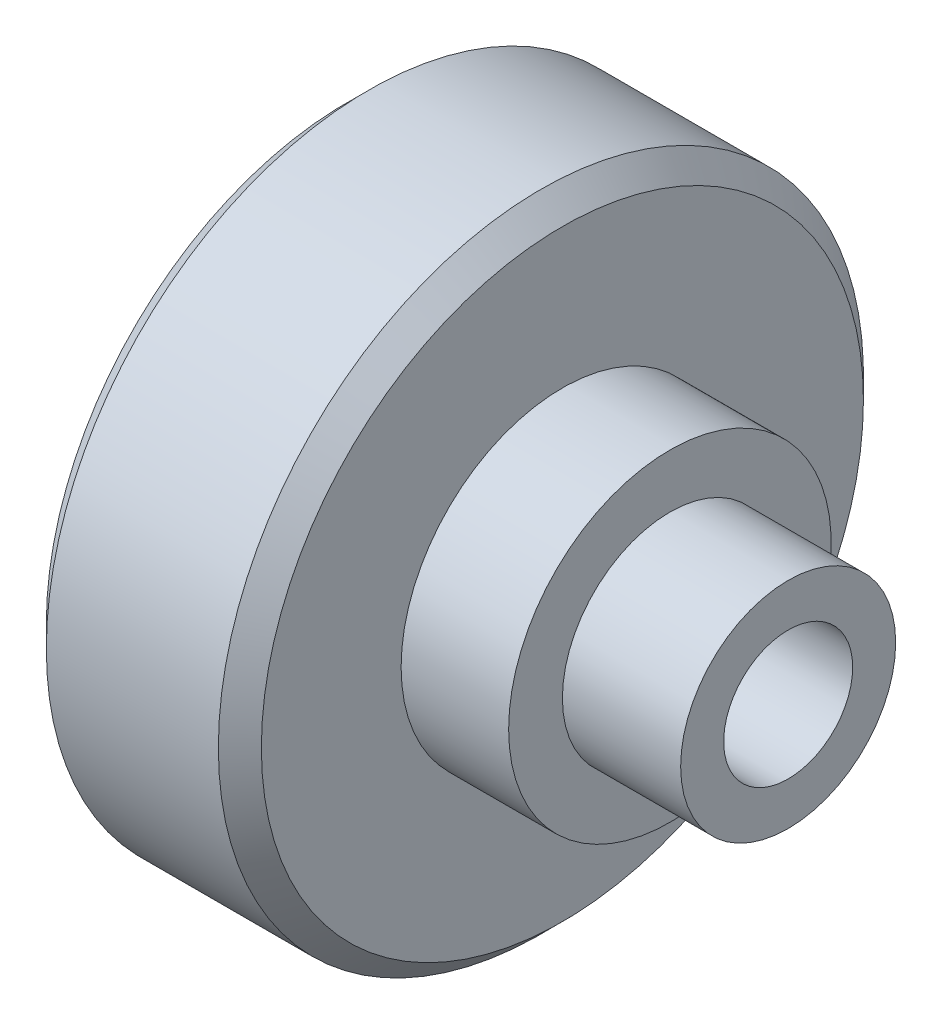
ISO-10303-21;
HEADER;
FILE_DESCRIPTION(('STEP AP214'),'2;1');
FILE_NAME('part.step','',(''),(''),'','','');
FILE_SCHEMA(('AUTOMOTIVE_DESIGN { 1 0 10303 214 1 1 1 1 }'));
ENDSEC;
DATA;
#1=APPLICATION_CONTEXT('core data for automotive mechanical design processes');
#2=APPLICATION_PROTOCOL_DEFINITION('international standard','automotive_design',2000,#1);
#3=PRODUCT_CONTEXT('',#1,'mechanical');
#4=PRODUCT('Part','Part','',(#3));
#5=PRODUCT_RELATED_PRODUCT_CATEGORY('part','',(#4));
#6=PRODUCT_DEFINITION_FORMATION('','',#4);
#7=PRODUCT_DEFINITION_CONTEXT('part definition',#1,'design');
#8=PRODUCT_DEFINITION('design','',#6,#7);
#9=PRODUCT_DEFINITION_SHAPE('','',#8);
#10=(LENGTH_UNIT() NAMED_UNIT(*) SI_UNIT(.MILLI.,.METRE.));
#11=(NAMED_UNIT(*) PLANE_ANGLE_UNIT() SI_UNIT($,.RADIAN.));
#12=(NAMED_UNIT(*) SI_UNIT($,.STERADIAN.) SOLID_ANGLE_UNIT());
#13=UNCERTAINTY_MEASURE_WITH_UNIT(LENGTH_MEASURE(1.E-05),#10,'distance_accuracy_value','');
#14=(GEOMETRIC_REPRESENTATION_CONTEXT(3) GLOBAL_UNCERTAINTY_ASSIGNED_CONTEXT((#13)) GLOBAL_UNIT_ASSIGNED_CONTEXT((#10,
#11,#12)) REPRESENTATION_CONTEXT('',''));
#15=CARTESIAN_POINT('',(0.,0.,0.));
#16=DIRECTION('',(0.,0.,1.));
#17=DIRECTION('',(1.,0.,0.));
#18=AXIS2_PLACEMENT_3D('',#15,#16,#17);
#19=CARTESIAN_POINT('',(0.,0.,-15.));
#20=DIRECTION('',(1.,0.,0.));
#21=DIRECTION('',(0.,0.,-1.));
#22=AXIS2_PLACEMENT_3D('',#19,#20,#21);
#23=PLANE('',#22);
#24=CARTESIAN_POINT('',(0.,0.,0.));
#25=DIRECTION('',(1.,0.,0.));
#26=DIRECTION('',(0.,0.,-1.));
#27=AXIS2_PLACEMENT_3D('',#24,#25,#26);
#28=CIRCLE('',#27,14.);
#29=CARTESIAN_POINT('',(0.,0.,-14.));
#30=VERTEX_POINT('',#29);
#31=EDGE_CURVE('E44',#30,#30,#28,.F.);
#32=ORIENTED_EDGE('',*,*,#31,.T.);
#33=EDGE_LOOP('',(#32));
#34=FACE_BOUND('',#33,.T.);
#35=CARTESIAN_POINT('',(0.,0.,0.));
#36=DIRECTION('',(1.,0.,0.));
#37=DIRECTION('',(0.,0.,-1.));
#38=AXIS2_PLACEMENT_3D('',#35,#36,#37);
#39=CIRCLE('',#38,3.);
#40=CARTESIAN_POINT('',(0.,0.,-3.));
#41=VERTEX_POINT('',#40);
#42=EDGE_CURVE('E61',#41,#41,#39,.T.);
#43=ORIENTED_EDGE('',*,*,#42,.T.);
#44=EDGE_LOOP('',(#43));
#45=FACE_BOUND('',#44,.T.);
#46=ADVANCED_FACE('F30',(#34,#45),#23,.F.);
#47=CARTESIAN_POINT('',(20.5,0.,0.));
#48=DIRECTION('',(-1.,0.,0.));
#49=DIRECTION('',(0.,0.,1.));
#50=AXIS2_PLACEMENT_3D('',#47,#48,#49);
#51=PLANE('',#50);
#52=CARTESIAN_POINT('',(20.5,0.,0.));
#53=DIRECTION('',(1.,0.,0.));
#54=DIRECTION('',(0.,0.,-1.));
#55=AXIS2_PLACEMENT_3D('',#52,#53,#54);
#56=CIRCLE('',#55,3.);
#57=CARTESIAN_POINT('',(20.5,0.,-3.));
#58=VERTEX_POINT('',#57);
#59=EDGE_CURVE('E64',#58,#58,#56,.T.);
#60=ORIENTED_EDGE('',*,*,#59,.F.);
#61=EDGE_LOOP('',(#60));
#62=FACE_BOUND('',#61,.T.);
#63=CARTESIAN_POINT('',(20.5,0.,0.));
#64=DIRECTION('',(-1.,0.,0.));
#65=DIRECTION('',(0.,0.,1.));
#66=AXIS2_PLACEMENT_3D('',#63,#64,#65);
#67=CIRCLE('',#66,4.99999999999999);
#68=CARTESIAN_POINT('',(20.5,0.,4.99999999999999));
#69=VERTEX_POINT('',#68);
#70=EDGE_CURVE('E49',#69,#69,#67,.T.);
#71=ORIENTED_EDGE('',*,*,#70,.F.);
#72=EDGE_LOOP('',(#71));
#73=FACE_BOUND('',#72,.T.);
#74=ADVANCED_FACE('F70',(#62,#73),#51,.F.);
#75=CARTESIAN_POINT('',(0.,0.,0.));
#76=DIRECTION('',(-1.,0.,0.));
#77=DIRECTION('',(0.,0.,1.));
#78=AXIS2_PLACEMENT_3D('',#75,#76,#77);
#79=CYLINDRICAL_SURFACE('',#78,4.99999999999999);
#80=CARTESIAN_POINT('',(15.,0.,0.));
#81=DIRECTION('',(-1.,0.,0.));
#82=DIRECTION('',(0.,0.,1.));
#83=AXIS2_PLACEMENT_3D('',#80,#81,#82);
#84=CIRCLE('',#83,4.99999999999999);
#85=CARTESIAN_POINT('',(15.,0.,4.99999999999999));
#86=VERTEX_POINT('',#85);
#87=EDGE_CURVE('E52',#86,#86,#84,.T.);
#88=ORIENTED_EDGE('',*,*,#87,.F.);
#89=EDGE_LOOP('',(#88));
#90=FACE_BOUND('',#89,.T.);
#91=ORIENTED_EDGE('',*,*,#70,.T.);
#92=EDGE_LOOP('',(#91));
#93=FACE_BOUND('',#92,.T.);
#94=ADVANCED_FACE('F73',(#90,#93),#79,.T.);
#95=CARTESIAN_POINT('',(15.,0.,-4.99999999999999));
#96=DIRECTION('',(-1.,0.,0.));
#97=DIRECTION('',(0.,0.,1.));
#98=AXIS2_PLACEMENT_3D('',#95,#96,#97);
#99=PLANE('',#98);
#100=CARTESIAN_POINT('',(15.,0.,0.));
#101=DIRECTION('',(-1.,0.,0.));
#102=DIRECTION('',(0.,0.,1.));
#103=AXIS2_PLACEMENT_3D('',#100,#101,#102);
#104=CIRCLE('',#103,7.49999999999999);
#105=CARTESIAN_POINT('',(15.,0.,7.49999999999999));
#106=VERTEX_POINT('',#105);
#107=EDGE_CURVE('E55',#106,#106,#104,.T.);
#108=ORIENTED_EDGE('',*,*,#107,.F.);
#109=EDGE_LOOP('',(#108));
#110=FACE_BOUND('',#109,.T.);
#111=ORIENTED_EDGE('',*,*,#87,.T.);
#112=EDGE_LOOP('',(#111));
#113=FACE_BOUND('',#112,.T.);
#114=ADVANCED_FACE('F77',(#110,#113),#99,.F.);
#115=CARTESIAN_POINT('',(0.,0.,0.));
#116=DIRECTION('',(-1.,0.,0.));
#117=DIRECTION('',(0.,0.,1.));
#118=AXIS2_PLACEMENT_3D('',#115,#116,#117);
#119=CYLINDRICAL_SURFACE('',#118,7.49999999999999);
#120=CARTESIAN_POINT('',(9.99999999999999,0.,0.));
#121=DIRECTION('',(-1.,0.,0.));
#122=DIRECTION('',(0.,0.,1.));
#123=AXIS2_PLACEMENT_3D('',#120,#121,#122);
#124=CIRCLE('',#123,7.49999999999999);
#125=CARTESIAN_POINT('',(9.99999999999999,0.,7.49999999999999));
#126=VERTEX_POINT('',#125);
#127=EDGE_CURVE('E58',#126,#126,#124,.T.);
#128=ORIENTED_EDGE('',*,*,#127,.F.);
#129=EDGE_LOOP('',(#128));
#130=FACE_BOUND('',#129,.T.);
#131=ORIENTED_EDGE('',*,*,#107,.T.);
#132=EDGE_LOOP('',(#131));
#133=FACE_BOUND('',#132,.T.);
#134=ADVANCED_FACE('F83',(#130,#133),#119,.T.);
#135=CARTESIAN_POINT('',(9.99999999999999,0.,-7.49999999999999));
#136=DIRECTION('',(-1.,0.,0.));
#137=DIRECTION('',(0.,0.,1.));
#138=AXIS2_PLACEMENT_3D('',#135,#136,#137);
#139=PLANE('',#138);
#140=CARTESIAN_POINT('',(9.99999999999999,0.,0.));
#141=DIRECTION('',(-1.,0.,0.));
#142=DIRECTION('',(0.,0.,1.));
#143=AXIS2_PLACEMENT_3D('',#140,#141,#142);
#144=CIRCLE('',#143,14.);
#145=CARTESIAN_POINT('',(9.99999999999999,0.,14.));
#146=VERTEX_POINT('',#145);
#147=EDGE_CURVE('E10',#146,#146,#144,.F.);
#148=ORIENTED_EDGE('',*,*,#147,.T.);
#149=EDGE_LOOP('',(#148));
#150=FACE_BOUND('',#149,.T.);
#151=ORIENTED_EDGE('',*,*,#127,.T.);
#152=EDGE_LOOP('',(#151));
#153=FACE_BOUND('',#152,.T.);
#154=ADVANCED_FACE('F106',(#150,#153),#139,.F.);
#155=CARTESIAN_POINT('',(0.,0.,0.));
#156=DIRECTION('',(-1.,0.,0.));
#157=DIRECTION('',(0.,0.,1.));
#158=AXIS2_PLACEMENT_3D('',#155,#156,#157);
#159=CYLINDRICAL_SURFACE('',#158,15.);
#160=CARTESIAN_POINT('',(1.,0.,0.));
#161=DIRECTION('',(1.,0.,0.));
#162=DIRECTION('',(0.,0.,-1.));
#163=AXIS2_PLACEMENT_3D('',#160,#161,#162);
#164=CIRCLE('',#163,15.);
#165=CARTESIAN_POINT('',(1.,0.,-15.));
#166=VERTEX_POINT('',#165);
#167=EDGE_CURVE('E36',#166,#166,#164,.T.);
#168=ORIENTED_EDGE('',*,*,#167,.T.);
#169=EDGE_LOOP('',(#168));
#170=FACE_BOUND('',#169,.T.);
#171=CARTESIAN_POINT('',(8.99999999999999,0.,0.));
#172=DIRECTION('',(-1.,0.,0.));
#173=DIRECTION('',(0.,0.,1.));
#174=AXIS2_PLACEMENT_3D('',#171,#172,#173);
#175=CIRCLE('',#174,15.);
#176=CARTESIAN_POINT('',(8.99999999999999,0.,15.));
#177=VERTEX_POINT('',#176);
#178=EDGE_CURVE('E40',#177,#177,#175,.T.);
#179=ORIENTED_EDGE('',*,*,#178,.T.);
#180=EDGE_LOOP('',(#179));
#181=FACE_BOUND('',#180,.T.);
#182=ADVANCED_FACE('F97',(#170,#181),#159,.T.);
#183=CARTESIAN_POINT('',(0.,0.,0.));
#184=DIRECTION('',(1.,0.,0.));
#185=DIRECTION('',(0.,0.,-1.));
#186=AXIS2_PLACEMENT_3D('',#183,#184,#185);
#187=CYLINDRICAL_SURFACE('',#186,3.);
#188=CARTESIAN_POINT('',(0.,0.,-3.));
#189=CARTESIAN_POINT('',(0.21354166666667,0.,-3.));
#190=CARTESIAN_POINT('',(0.427083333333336,0.,-3.));
#191=CARTESIAN_POINT('',(0.854166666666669,0.,-3.));
#192=CARTESIAN_POINT('',(1.06770833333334,0.,-3.));
#193=CARTESIAN_POINT('',(1.49479166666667,0.,-3.));
#194=CARTESIAN_POINT('',(1.70833333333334,0.,-3.));
#195=CARTESIAN_POINT('',(2.13541666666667,0.,-3.));
#196=CARTESIAN_POINT('',(2.34895833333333,0.,-3.));
#197=CARTESIAN_POINT('',(2.77604166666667,0.,-3.));
#198=CARTESIAN_POINT('',(2.98958333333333,0.,-3.));
#199=CARTESIAN_POINT('',(3.41666666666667,0.,-3.));
#200=CARTESIAN_POINT('',(3.63020833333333,0.,-3.));
#201=CARTESIAN_POINT('',(4.05729166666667,0.,-3.));
#202=CARTESIAN_POINT('',(4.27083333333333,0.,-3.));
#203=CARTESIAN_POINT('',(4.69791666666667,0.,-3.));
#204=CARTESIAN_POINT('',(4.91145833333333,0.,-3.));
#205=CARTESIAN_POINT('',(5.33854166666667,0.,-3.));
#206=CARTESIAN_POINT('',(5.55208333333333,0.,-3.));
#207=CARTESIAN_POINT('',(5.97916666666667,0.,-3.));
#208=CARTESIAN_POINT('',(6.19270833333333,0.,-3.));
#209=CARTESIAN_POINT('',(6.61979166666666,0.,-3.));
#210=CARTESIAN_POINT('',(6.83333333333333,0.,-3.));
#211=CARTESIAN_POINT('',(7.26041666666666,0.,-3.));
#212=CARTESIAN_POINT('',(7.47395833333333,0.,-3.));
#213=CARTESIAN_POINT('',(7.90104166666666,0.,-3.));
#214=CARTESIAN_POINT('',(8.11458333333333,0.,-3.));
#215=CARTESIAN_POINT('',(8.54166666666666,0.,-3.));
#216=CARTESIAN_POINT('',(8.75520833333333,0.,-3.));
#217=CARTESIAN_POINT('',(9.18229166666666,0.,-3.));
#218=CARTESIAN_POINT('',(9.39583333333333,0.,-3.));
#219=CARTESIAN_POINT('',(9.82291666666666,0.,-3.));
#220=CARTESIAN_POINT('',(10.0364583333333,0.,-3.));
#221=CARTESIAN_POINT('',(10.4635416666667,0.,-3.));
#222=CARTESIAN_POINT('',(10.6770833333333,0.,-3.));
#223=CARTESIAN_POINT('',(11.1041666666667,0.,-3.));
#224=CARTESIAN_POINT('',(11.3177083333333,0.,-3.));
#225=CARTESIAN_POINT('',(11.7447916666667,0.,-3.));
#226=CARTESIAN_POINT('',(11.9583333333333,0.,-3.));
#227=CARTESIAN_POINT('',(12.3854166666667,0.,-3.));
#228=CARTESIAN_POINT('',(12.5989583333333,0.,-3.));
#229=CARTESIAN_POINT('',(13.0260416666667,0.,-3.));
#230=CARTESIAN_POINT('',(13.2395833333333,0.,-3.));
#231=CARTESIAN_POINT('',(13.6666666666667,0.,-3.));
#232=CARTESIAN_POINT('',(13.8802083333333,0.,-3.));
#233=CARTESIAN_POINT('',(14.3072916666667,0.,-3.));
#234=CARTESIAN_POINT('',(14.5208333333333,0.,-3.));
#235=CARTESIAN_POINT('',(14.9479166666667,0.,-3.));
#236=CARTESIAN_POINT('',(15.1614583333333,0.,-3.));
#237=CARTESIAN_POINT('',(15.5885416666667,0.,-3.));
#238=CARTESIAN_POINT('',(15.8020833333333,0.,-3.));
#239=CARTESIAN_POINT('',(16.2291666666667,0.,-3.));
#240=CARTESIAN_POINT('',(16.4427083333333,0.,-3.));
#241=CARTESIAN_POINT('',(16.8697916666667,0.,-3.));
#242=CARTESIAN_POINT('',(17.0833333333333,0.,-3.));
#243=CARTESIAN_POINT('',(17.5104166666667,0.,-3.));
#244=CARTESIAN_POINT('',(17.7239583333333,0.,-3.));
#245=CARTESIAN_POINT('',(18.1510416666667,0.,-3.));
#246=CARTESIAN_POINT('',(18.3645833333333,0.,-3.));
#247=CARTESIAN_POINT('',(18.7916666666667,0.,-3.));
#248=CARTESIAN_POINT('',(19.0052083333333,0.,-3.));
#249=CARTESIAN_POINT('',(19.4322916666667,0.,-3.));
#250=CARTESIAN_POINT('',(19.6458333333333,0.,-3.));
#251=CARTESIAN_POINT('',(20.0729166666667,0.,-3.));
#252=CARTESIAN_POINT('',(20.2864583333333,0.,-3.));
#253=CARTESIAN_POINT('',(20.5,0.,-3.));
#254=B_SPLINE_CURVE_WITH_KNOTS('',3,(#188,#189,#190,#191,#192,#193,#194,#195,#196,#197,#198,
#199,#200,#201,#202,#203,#204,#205,#206,#207,#208,#209,#210,#211,#212,#213,#214,#215,#216,#217,
#218,#219,#220,#221,#222,#223,#224,#225,#226,#227,#228,#229,#230,#231,#232,#233,#234,#235,#236,
#237,#238,#239,#240,#241,#242,#243,#244,#245,#246,#247,#248,#249,#250,#251,#252,#253),
.UNSPECIFIED.,.F.,.F.,(4,2,2,2,2,2,2,2,2,2,2,2,2,2,2,2,2,2,2,2,2,2,2,2,2,2,2,2,2,2,2,2,4),(0.,
0.640624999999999,1.28125,1.921875,2.5625,3.203125,3.84375,4.484375,5.12499999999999,
5.76562499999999,6.40624999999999,7.04687499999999,7.68749999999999,8.32812499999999,
8.96874999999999,9.60937499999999,10.25,10.890625,11.53125,12.171875,12.8125,13.453125,14.09375,
14.734375,15.375,16.015625,16.65625,17.296875,17.9375,18.578125,19.21875,19.859375,20.5),.UNSPECIFIED.);
#255=EDGE_CURVE('BSEAM68',#41,#58,#254,.T.);
#256=ORIENTED_EDGE('',*,*,#42,.F.);
#257=ORIENTED_EDGE('',*,*,#59,.T.);
#258=ORIENTED_EDGE('',*,*,#255,.T.);
#259=ORIENTED_EDGE('',*,*,#255,.F.);
#260=EDGE_LOOP('',(#256,#258,#257,#259));
#261=FACE_BOUND('',#260,.T.);
#262=ADVANCED_FACE('F68',(#261),#187,.F.);
#263=CARTESIAN_POINT('',(0.,0.,0.));
#264=DIRECTION('',(1.,0.,0.));
#265=DIRECTION('',(0.,0.,-1.));
#266=AXIS2_PLACEMENT_3D('',#263,#264,#265);
#267=CONICAL_SURFACE('',#266,14.,0.785398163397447);
#268=ORIENTED_EDGE('',*,*,#167,.F.);
#269=EDGE_LOOP('',(#268));
#270=FACE_BOUND('',#269,.T.);
#271=ORIENTED_EDGE('',*,*,#31,.F.);
#272=EDGE_LOOP('',(#271));
#273=FACE_BOUND('',#272,.T.);
#274=ADVANCED_FACE('F96',(#270,#273),#267,.T.);
#275=CARTESIAN_POINT('',(8.99999999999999,0.,0.));
#276=DIRECTION('',(-1.,0.,0.));
#277=DIRECTION('',(0.,0.,1.));
#278=AXIS2_PLACEMENT_3D('',#275,#276,#277);
#279=CONICAL_SURFACE('',#278,15.,0.785398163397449);
#280=ORIENTED_EDGE('',*,*,#147,.F.);
#281=EDGE_LOOP('',(#280));
#282=FACE_BOUND('',#281,.T.);
#283=ORIENTED_EDGE('',*,*,#178,.F.);
#284=EDGE_LOOP('',(#283));
#285=FACE_BOUND('',#284,.T.);
#286=ADVANCED_FACE('F103',(#282,#285),#279,.T.);
#287=CLOSED_SHELL('',(#46,#74,#94,#114,#134,#154,#182,#262,#274,#286));
#288=MANIFOLD_SOLID_BREP('B2',#287);
#289=ADVANCED_BREP_SHAPE_REPRESENTATION('',(#18,#288),#14);
#290=SHAPE_DEFINITION_REPRESENTATION(#9,#289);
ENDSEC;
END-ISO-10303-21;
